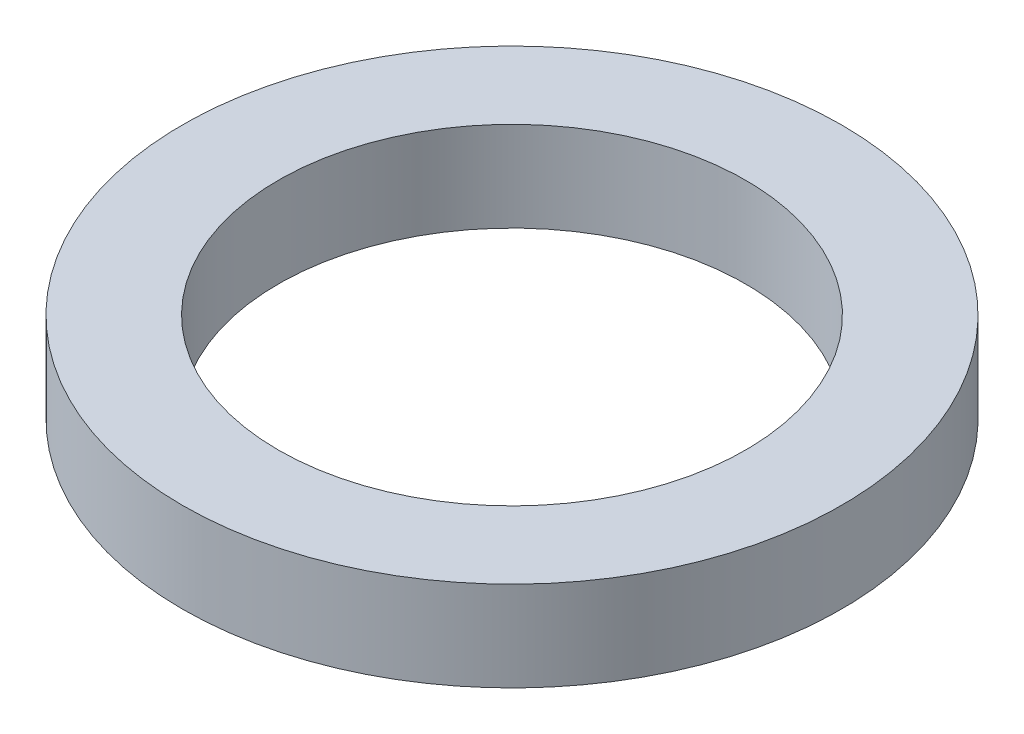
ISO-10303-21;
HEADER;
FILE_DESCRIPTION(('STEP AP214'),'2;1');
FILE_NAME('part.step','',(''),(''),'','','');
FILE_SCHEMA(('AUTOMOTIVE_DESIGN { 1 0 10303 214 1 1 1 1 }'));
ENDSEC;
DATA;
#1=APPLICATION_CONTEXT('core data for automotive mechanical design processes');
#2=APPLICATION_PROTOCOL_DEFINITION('international standard','automotive_design',2000,#1);
#3=PRODUCT_CONTEXT('',#1,'mechanical');
#4=PRODUCT('Part','Part','',(#3));
#5=PRODUCT_RELATED_PRODUCT_CATEGORY('part','',(#4));
#6=PRODUCT_DEFINITION_FORMATION('','',#4);
#7=PRODUCT_DEFINITION_CONTEXT('part definition',#1,'design');
#8=PRODUCT_DEFINITION('design','',#6,#7);
#9=PRODUCT_DEFINITION_SHAPE('','',#8);
#10=(LENGTH_UNIT() NAMED_UNIT(*) SI_UNIT(.MILLI.,.METRE.));
#11=(NAMED_UNIT(*) PLANE_ANGLE_UNIT() SI_UNIT($,.RADIAN.));
#12=(NAMED_UNIT(*) SI_UNIT($,.STERADIAN.) SOLID_ANGLE_UNIT());
#13=UNCERTAINTY_MEASURE_WITH_UNIT(LENGTH_MEASURE(1.E-05),#10,'distance_accuracy_value','');
#14=(GEOMETRIC_REPRESENTATION_CONTEXT(3) GLOBAL_UNCERTAINTY_ASSIGNED_CONTEXT((#13)) GLOBAL_UNIT_ASSIGNED_CONTEXT((#10,
#11,#12)) REPRESENTATION_CONTEXT('',''));
#15=CARTESIAN_POINT('',(0.,0.,0.));
#16=DIRECTION('',(0.,0.,1.));
#17=DIRECTION('',(1.,0.,0.));
#18=AXIS2_PLACEMENT_3D('',#15,#16,#17);
#19=CARTESIAN_POINT('',(0.,15.,0.));
#20=DIRECTION('',(0.,1.,0.));
#21=DIRECTION('',(0.,0.,1.));
#22=AXIS2_PLACEMENT_3D('',#19,#20,#21);
#23=PLANE('',#22);
#24=CARTESIAN_POINT('',(0.,15.,0.));
#25=DIRECTION('',(0.,1.,0.));
#26=DIRECTION('',(0.,0.,1.));
#27=AXIS2_PLACEMENT_3D('',#24,#25,#26);
#28=CIRCLE('',#27,55.);
#29=CARTESIAN_POINT('',(0.,15.,55.));
#30=VERTEX_POINT('',#29);
#31=EDGE_CURVE('E12',#30,#30,#28,.T.);
#32=ORIENTED_EDGE('',*,*,#31,.T.);
#33=EDGE_LOOP('',(#32));
#34=FACE_BOUND('',#33,.T.);
#35=CARTESIAN_POINT('',(0.,15.,0.));
#36=DIRECTION('',(0.,1.,0.));
#37=DIRECTION('',(0.,0.,1.));
#38=AXIS2_PLACEMENT_3D('',#35,#36,#37);
#39=CIRCLE('',#38,39.);
#40=CARTESIAN_POINT('',(0.,15.,39.));
#41=VERTEX_POINT('',#40);
#42=EDGE_CURVE('E52',#41,#41,#39,.T.);
#43=ORIENTED_EDGE('',*,*,#42,.F.);
#44=EDGE_LOOP('',(#43));
#45=FACE_BOUND('',#44,.T.);
#46=ADVANCED_FACE('F41',(#34,#45),#23,.T.);
#47=CARTESIAN_POINT('',(0.,0.,0.));
#48=DIRECTION('',(0.,1.,0.));
#49=DIRECTION('',(0.,0.,1.));
#50=AXIS2_PLACEMENT_3D('',#47,#48,#49);
#51=PLANE('',#50);
#52=CARTESIAN_POINT('',(0.,0.,0.));
#53=DIRECTION('',(0.,1.,0.));
#54=DIRECTION('',(0.,0.,1.));
#55=AXIS2_PLACEMENT_3D('',#52,#53,#54);
#56=CIRCLE('',#55,55.);
#57=CARTESIAN_POINT('',(0.,0.,55.));
#58=VERTEX_POINT('',#57);
#59=EDGE_CURVE('E45',#58,#58,#56,.T.);
#60=ORIENTED_EDGE('',*,*,#59,.F.);
#61=EDGE_LOOP('',(#60));
#62=FACE_BOUND('',#61,.T.);
#63=CARTESIAN_POINT('',(0.,0.,0.));
#64=DIRECTION('',(0.,1.,0.));
#65=DIRECTION('',(0.,0.,1.));
#66=AXIS2_PLACEMENT_3D('',#63,#64,#65);
#67=CIRCLE('',#66,39.);
#68=CARTESIAN_POINT('',(0.,0.,39.));
#69=VERTEX_POINT('',#68);
#70=EDGE_CURVE('E54',#69,#69,#67,.T.);
#71=ORIENTED_EDGE('',*,*,#70,.T.);
#72=EDGE_LOOP('',(#71));
#73=FACE_BOUND('',#72,.T.);
#74=ADVANCED_FACE('F64',(#62,#73),#51,.F.);
#75=CARTESIAN_POINT('',(0.,15.,0.));
#76=DIRECTION('',(0.,-1.,0.));
#77=DIRECTION('',(0.,0.,-1.));
#78=AXIS2_PLACEMENT_3D('',#75,#76,#77);
#79=CYLINDRICAL_SURFACE('',#78,55.);
#80=ORIENTED_EDGE('',*,*,#31,.F.);
#81=EDGE_LOOP('',(#80));
#82=FACE_BOUND('',#81,.T.);
#83=ORIENTED_EDGE('',*,*,#59,.T.);
#84=EDGE_LOOP('',(#83));
#85=FACE_BOUND('',#84,.T.);
#86=ADVANCED_FACE('F43',(#82,#85),#79,.T.);
#87=CARTESIAN_POINT('',(0.,15.,0.));
#88=DIRECTION('',(0.,-1.,0.));
#89=DIRECTION('',(0.,0.,-1.));
#90=AXIS2_PLACEMENT_3D('',#87,#88,#89);
#91=CYLINDRICAL_SURFACE('',#90,39.);
#92=ORIENTED_EDGE('',*,*,#42,.T.);
#93=EDGE_LOOP('',(#92));
#94=FACE_BOUND('',#93,.T.);
#95=ORIENTED_EDGE('',*,*,#70,.F.);
#96=EDGE_LOOP('',(#95));
#97=FACE_BOUND('',#96,.T.);
#98=ADVANCED_FACE('F60',(#94,#97),#91,.F.);
#99=CLOSED_SHELL('',(#46,#74,#86,#98));
#100=MANIFOLD_SOLID_BREP('B2',#99);
#101=ADVANCED_BREP_SHAPE_REPRESENTATION('',(#18,#100),#14);
#102=SHAPE_DEFINITION_REPRESENTATION(#9,#101);
ENDSEC;
END-ISO-10303-21;
